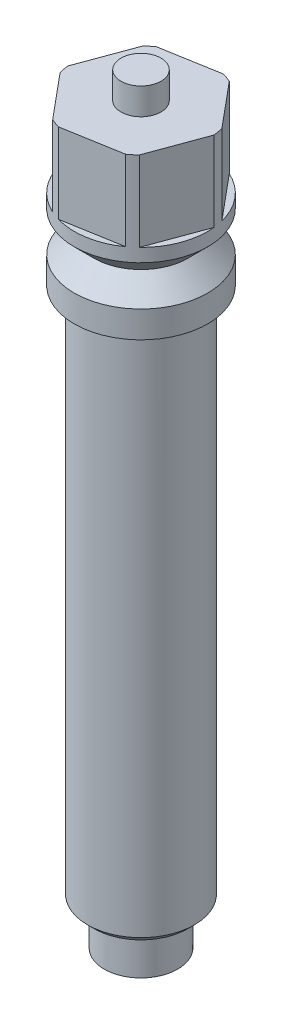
ISO-10303-21;
HEADER;
FILE_DESCRIPTION(('STEP AP214'),'2;1');
FILE_NAME('part.step','',(''),(''),'','','');
FILE_SCHEMA(('AUTOMOTIVE_DESIGN { 1 0 10303 214 1 1 1 1 }'));
ENDSEC;
DATA;
#1=APPLICATION_CONTEXT('core data for automotive mechanical design processes');
#2=APPLICATION_PROTOCOL_DEFINITION('international standard','automotive_design',2000,#1);
#3=PRODUCT_CONTEXT('',#1,'mechanical');
#4=PRODUCT('Part','Part','',(#3));
#5=PRODUCT_RELATED_PRODUCT_CATEGORY('part','',(#4));
#6=PRODUCT_DEFINITION_FORMATION('','',#4);
#7=PRODUCT_DEFINITION_CONTEXT('part definition',#1,'design');
#8=PRODUCT_DEFINITION('design','',#6,#7);
#9=PRODUCT_DEFINITION_SHAPE('','',#8);
#10=(LENGTH_UNIT() NAMED_UNIT(*) SI_UNIT(.MILLI.,.METRE.));
#11=(NAMED_UNIT(*) PLANE_ANGLE_UNIT() SI_UNIT($,.RADIAN.));
#12=(NAMED_UNIT(*) SI_UNIT($,.STERADIAN.) SOLID_ANGLE_UNIT());
#13=UNCERTAINTY_MEASURE_WITH_UNIT(LENGTH_MEASURE(1.E-05),#10,'distance_accuracy_value','');
#14=(GEOMETRIC_REPRESENTATION_CONTEXT(3) GLOBAL_UNCERTAINTY_ASSIGNED_CONTEXT((#13)) GLOBAL_UNIT_ASSIGNED_CONTEXT((#10,
#11,#12)) REPRESENTATION_CONTEXT('',''));
#15=CARTESIAN_POINT('',(0.,0.,0.));
#16=DIRECTION('',(0.,0.,1.));
#17=DIRECTION('',(1.,0.,0.));
#18=AXIS2_PLACEMENT_3D('',#15,#16,#17);
#19=CARTESIAN_POINT('',(0.,-40.,0.));
#20=DIRECTION('',(0.,-1.,0.));
#21=DIRECTION('',(0.,0.,-1.));
#22=AXIS2_PLACEMENT_3D('',#19,#20,#21);
#23=PLANE('',#22);
#24=CARTESIAN_POINT('',(0.,-40.,0.));
#25=DIRECTION('',(0.,-1.,0.));
#26=DIRECTION('',(0.,0.,-1.));
#27=AXIS2_PLACEMENT_3D('',#24,#25,#26);
#28=CIRCLE('',#27,3.5);
#29=CARTESIAN_POINT('',(0.,-40.,-3.5));
#30=VERTEX_POINT('',#29);
#31=EDGE_CURVE('E356',#30,#30,#28,.T.);
#32=ORIENTED_EDGE('',*,*,#31,.T.);
#33=EDGE_LOOP('',(#32));
#34=FACE_BOUND('',#33,.T.);
#35=CARTESIAN_POINT('',(0.,-40.,0.));
#36=DIRECTION('',(0.,-1.,0.));
#37=DIRECTION('',(0.,0.,-1.));
#38=AXIS2_PLACEMENT_3D('',#35,#36,#37);
#39=CIRCLE('',#38,2.75);
#40=CARTESIAN_POINT('',(0.,-40.,-2.75));
#41=VERTEX_POINT('',#40);
#42=EDGE_CURVE('E626',#41,#41,#39,.T.);
#43=ORIENTED_EDGE('',*,*,#42,.F.);
#44=EDGE_LOOP('',(#43));
#45=FACE_BOUND('',#44,.T.);
#46=ADVANCED_FACE('F348',(#34,#45),#23,.T.);
#47=CARTESIAN_POINT('',(0.,0.,0.));
#48=DIRECTION('',(0.,1.,0.));
#49=DIRECTION('',(0.,0.,1.));
#50=AXIS2_PLACEMENT_3D('',#47,#48,#49);
#51=PLANE('',#50);
#52=CARTESIAN_POINT('',(0.,0.,0.));
#53=DIRECTION('',(0.,1.,0.));
#54=DIRECTION('',(0.,0.,1.));
#55=AXIS2_PLACEMENT_3D('',#52,#53,#54);
#56=CIRCLE('',#55,5.);
#57=CARTESIAN_POINT('',(0.,0.,5.));
#58=VERTEX_POINT('',#57);
#59=EDGE_CURVE('E472',#58,#58,#56,.T.);
#60=ORIENTED_EDGE('',*,*,#59,.F.);
#61=EDGE_LOOP('',(#60));
#62=FACE_BOUND('',#61,.T.);
#63=CARTESIAN_POINT('',(0.,0.,0.));
#64=DIRECTION('',(0.,1.,0.));
#65=DIRECTION('',(0.,0.,1.));
#66=AXIS2_PLACEMENT_3D('',#63,#64,#65);
#67=CIRCLE('',#66,4.);
#68=CARTESIAN_POINT('',(0.,0.,4.));
#69=VERTEX_POINT('',#68);
#70=EDGE_CURVE('E500',#69,#69,#67,.F.);
#71=ORIENTED_EDGE('',*,*,#70,.F.);
#72=EDGE_LOOP('',(#71));
#73=FACE_BOUND('',#72,.T.);
#74=ADVANCED_FACE('F521',(#62,#73),#51,.F.);
#75=CARTESIAN_POINT('',(0.,12.,0.));
#76=DIRECTION('',(0.,1.,0.));
#77=DIRECTION('',(0.,0.,1.));
#78=AXIS2_PLACEMENT_3D('',#75,#76,#77);
#79=PLANE('',#78);
#80=CARTESIAN_POINT('',(0.,12.,0.));
#81=DIRECTION('',(0.,1.,0.));
#82=DIRECTION('',(0.,0.,1.));
#83=AXIS2_PLACEMENT_3D('',#80,#81,#82);
#84=CIRCLE('',#83,1.5);
#85=CARTESIAN_POINT('',(0.,12.,1.5));
#86=VERTEX_POINT('',#85);
#87=EDGE_CURVE('E586',#86,#86,#84,.T.);
#88=ORIENTED_EDGE('',*,*,#87,.F.);
#89=EDGE_LOOP('',(#88));
#90=FACE_BOUND('',#89,.T.);
#91=CARTESIAN_POINT('',(0.,12.,0.));
#92=DIRECTION('',(0.,1.,0.));
#93=DIRECTION('',(0.,0.,1.));
#94=AXIS2_PLACEMENT_3D('',#91,#92,#93);
#95=CIRCLE('',#94,5.);
#96=CARTESIAN_POINT('',(2.06183256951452,12.,-4.5550901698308));
#97=VERTEX_POINT('',#96);
#98=CARTESIAN_POINT('',(1.38132784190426,12.,-4.80540668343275));
#99=VERTEX_POINT('',#98);
#100=EDGE_CURVE('E463',#97,#99,#95,.T.);
#101=ORIENTED_EDGE('',*,*,#100,.T.);
#102=DIRECTION('',(-0.985394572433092,0.,0.170286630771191));
#103=VECTOR('',#102,1.);
#104=CARTESIAN_POINT('',(1.79384035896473,12.,-4.87669322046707));
#105=LINE('',#104,#103);
#106=CARTESIAN_POINT('',(-2.91390751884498,12.,-4.06314446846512));
#107=VERTEX_POINT('',#106);
#108=EDGE_CURVE('E448',#99,#107,#105,.T.);
#109=ORIENTED_EDGE('',*,*,#108,.T.);
#110=CARTESIAN_POINT('',(-3.47094034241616,12.,-3.5989683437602));
#111=VERTEX_POINT('',#110);
#112=EDGE_CURVE('E455',#107,#111,#95,.T.);
#113=ORIENTED_EDGE('',*,*,#112,.T.);
#114=DIRECTION('',(-0.345224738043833,0.,0.938520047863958));
#115=VECTOR('',#114,1.);
#116=CARTESIAN_POINT('',(-3.32642003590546,12.,-3.99185793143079));
#117=LINE('',#116,#115);
#118=CARTESIAN_POINT('',(-4.9757400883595,12.,0.491945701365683));
#119=VERTEX_POINT('',#118);
#120=EDGE_CURVE('E436',#111,#119,#117,.T.);
#121=ORIENTED_EDGE('',*,*,#120,.T.);
#122=CARTESIAN_POINT('',(-4.85226818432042,12.,1.20643833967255));
#123=VERTEX_POINT('',#122);
#124=EDGE_CURVE('E464',#119,#123,#95,.T.);
#125=ORIENTED_EDGE('',*,*,#124,.T.);
#126=DIRECTION('',(0.640169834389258,0.,0.768233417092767));
#127=VECTOR('',#126,1.);
#128=CARTESIAN_POINT('',(-5.1202603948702,12.,0.884835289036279));
#129=LINE('',#128,#127);
#130=CARTESIAN_POINT('',(-2.06183256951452,12.,4.5550901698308));
#131=VERTEX_POINT('',#130);
#132=EDGE_CURVE('E447',#123,#131,#129,.T.);
#133=ORIENTED_EDGE('',*,*,#132,.T.);
#134=CARTESIAN_POINT('',(-1.38132784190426,12.,4.80540668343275));
#135=VERTEX_POINT('',#134);
#136=EDGE_CURVE('E467',#131,#135,#95,.T.);
#137=ORIENTED_EDGE('',*,*,#136,.T.);
#138=DIRECTION('',(0.985394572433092,0.,-0.170286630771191));
#139=VECTOR('',#138,1.);
#140=CARTESIAN_POINT('',(-1.79384035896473,12.,4.87669322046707));
#141=LINE('',#140,#139);
#142=CARTESIAN_POINT('',(2.91390751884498,12.,4.06314446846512));
#143=VERTEX_POINT('',#142);
#144=EDGE_CURVE('E608',#135,#143,#141,.T.);
#145=ORIENTED_EDGE('',*,*,#144,.T.);
#146=CARTESIAN_POINT('',(3.47094034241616,12.,3.5989683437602));
#147=VERTEX_POINT('',#146);
#148=EDGE_CURVE('E468',#143,#147,#95,.T.);
#149=ORIENTED_EDGE('',*,*,#148,.T.);
#150=DIRECTION('',(0.345224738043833,0.,-0.938520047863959));
#151=VECTOR('',#150,1.);
#152=CARTESIAN_POINT('',(3.32642003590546,12.,3.99185793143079));
#153=LINE('',#152,#151);
#154=CARTESIAN_POINT('',(4.9757400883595,12.,-0.491945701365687));
#155=VERTEX_POINT('',#154);
#156=EDGE_CURVE('E605',#147,#155,#153,.T.);
#157=ORIENTED_EDGE('',*,*,#156,.T.);
#158=CARTESIAN_POINT('',(4.85226818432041,12.,-1.20643833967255));
#159=VERTEX_POINT('',#158);
#160=EDGE_CURVE('E466',#155,#159,#95,.T.);
#161=ORIENTED_EDGE('',*,*,#160,.T.);
#162=DIRECTION('',(-0.640169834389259,0.,-0.768233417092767));
#163=VECTOR('',#162,1.);
#164=CARTESIAN_POINT('',(5.1202603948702,12.,-0.88483528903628));
#165=LINE('',#164,#163);
#166=EDGE_CURVE('E602',#159,#97,#165,.T.);
#167=ORIENTED_EDGE('',*,*,#166,.T.);
#168=EDGE_LOOP('',(#101,#109,#113,#121,#125,#133,#137,#145,#149,#157,#161,#167));
#169=FACE_BOUND('',#168,.T.);
#170=ADVANCED_FACE('F462',(#90,#169),#79,.T.);
#171=CARTESIAN_POINT('',(0.,12.,0.));
#172=DIRECTION('',(0.,-1.,0.));
#173=DIRECTION('',(0.,0.,-1.));
#174=AXIS2_PLACEMENT_3D('',#171,#172,#173);
#175=CYLINDRICAL_SURFACE('',#174,5.);
#176=CARTESIAN_POINT('',(0.,5.,0.));
#177=DIRECTION('',(0.,1.,0.));
#178=DIRECTION('',(0.,0.,1.));
#179=AXIS2_PLACEMENT_3D('',#176,#177,#178);
#180=CIRCLE('',#179,5.);
#181=CARTESIAN_POINT('',(0.,5.,5.));
#182=VERTEX_POINT('',#181);
#183=EDGE_CURVE('E617',#182,#182,#180,.T.);
#184=ORIENTED_EDGE('',*,*,#183,.T.);
#185=EDGE_LOOP('',(#184));
#186=FACE_BOUND('',#185,.T.);
#187=DIRECTION('',(0.,-1.,0.));
#188=VECTOR('',#187,1.);
#189=CARTESIAN_POINT('',(1.38132784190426,12.,-4.80540668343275));
#190=LINE('',#189,#188);
#191=CARTESIAN_POINT('',(1.38132784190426,6.,-4.80540668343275));
#192=VERTEX_POINT('',#191);
#193=EDGE_CURVE('E498',#99,#192,#190,.T.);
#194=ORIENTED_EDGE('',*,*,#193,.F.);
#195=ORIENTED_EDGE('',*,*,#100,.F.);
#196=DIRECTION('',(0.,-1.,0.));
#197=VECTOR('',#196,1.);
#198=CARTESIAN_POINT('',(2.06183256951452,12.,-4.5550901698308));
#199=LINE('',#198,#197);
#200=CARTESIAN_POINT('',(2.06183256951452,6.,-4.5550901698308));
#201=VERTEX_POINT('',#200);
#202=EDGE_CURVE('E491',#201,#97,#199,.F.);
#203=ORIENTED_EDGE('',*,*,#202,.F.);
#204=CARTESIAN_POINT('',(0.,6.,0.));
#205=DIRECTION('',(0.,1.,0.));
#206=DIRECTION('',(0.,0.,1.));
#207=AXIS2_PLACEMENT_3D('',#204,#205,#206);
#208=CIRCLE('',#207,5.);
#209=CARTESIAN_POINT('',(4.85226818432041,6.,-1.20643833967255));
#210=VERTEX_POINT('',#209);
#211=EDGE_CURVE('E493',#210,#201,#208,.T.);
#212=ORIENTED_EDGE('',*,*,#211,.F.);
#213=DIRECTION('',(0.,-1.,0.));
#214=VECTOR('',#213,1.);
#215=CARTESIAN_POINT('',(4.85226818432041,12.,-1.20643833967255));
#216=LINE('',#215,#214);
#217=EDGE_CURVE('E494',#159,#210,#216,.T.);
#218=ORIENTED_EDGE('',*,*,#217,.F.);
#219=ORIENTED_EDGE('',*,*,#160,.F.);
#220=DIRECTION('',(0.,-1.,0.));
#221=VECTOR('',#220,1.);
#222=CARTESIAN_POINT('',(4.9757400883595,12.,-0.491945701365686));
#223=LINE('',#222,#221);
#224=CARTESIAN_POINT('',(4.9757400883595,6.,-0.491945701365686));
#225=VERTEX_POINT('',#224);
#226=EDGE_CURVE('E486',#225,#155,#223,.F.);
#227=ORIENTED_EDGE('',*,*,#226,.F.);
#228=CARTESIAN_POINT('',(3.47094034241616,6.,3.5989683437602));
#229=VERTEX_POINT('',#228);
#230=EDGE_CURVE('E488',#229,#225,#208,.T.);
#231=ORIENTED_EDGE('',*,*,#230,.F.);
#232=DIRECTION('',(0.,-1.,0.));
#233=VECTOR('',#232,1.);
#234=CARTESIAN_POINT('',(3.47094034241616,12.,3.5989683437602));
#235=LINE('',#234,#233);
#236=EDGE_CURVE('E489',#147,#229,#235,.T.);
#237=ORIENTED_EDGE('',*,*,#236,.F.);
#238=ORIENTED_EDGE('',*,*,#148,.F.);
#239=DIRECTION('',(0.,-1.,0.));
#240=VECTOR('',#239,1.);
#241=CARTESIAN_POINT('',(2.91390751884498,12.,4.06314446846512));
#242=LINE('',#241,#240);
#243=CARTESIAN_POINT('',(2.91390751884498,6.,4.06314446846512));
#244=VERTEX_POINT('',#243);
#245=EDGE_CURVE('E481',#244,#143,#242,.F.);
#246=ORIENTED_EDGE('',*,*,#245,.F.);
#247=CARTESIAN_POINT('',(-1.38132784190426,6.,4.80540668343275));
#248=VERTEX_POINT('',#247);
#249=EDGE_CURVE('E483',#248,#244,#208,.T.);
#250=ORIENTED_EDGE('',*,*,#249,.F.);
#251=DIRECTION('',(0.,-1.,0.));
#252=VECTOR('',#251,1.);
#253=CARTESIAN_POINT('',(-1.38132784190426,12.,4.80540668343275));
#254=LINE('',#253,#252);
#255=EDGE_CURVE('E484',#135,#248,#254,.T.);
#256=ORIENTED_EDGE('',*,*,#255,.F.);
#257=ORIENTED_EDGE('',*,*,#136,.F.);
#258=DIRECTION('',(0.,-1.,0.));
#259=VECTOR('',#258,1.);
#260=CARTESIAN_POINT('',(-2.06183256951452,12.,4.5550901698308));
#261=LINE('',#260,#259);
#262=CARTESIAN_POINT('',(-2.06183256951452,6.,4.5550901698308));
#263=VERTEX_POINT('',#262);
#264=EDGE_CURVE('E458',#263,#131,#261,.F.);
#265=ORIENTED_EDGE('',*,*,#264,.F.);
#266=CARTESIAN_POINT('',(-4.85226818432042,6.,1.20643833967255));
#267=VERTEX_POINT('',#266);
#268=EDGE_CURVE('E476',#267,#263,#208,.T.);
#269=ORIENTED_EDGE('',*,*,#268,.F.);
#270=DIRECTION('',(0.,-1.,0.));
#271=VECTOR('',#270,1.);
#272=CARTESIAN_POINT('',(-4.85226818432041,12.,1.20643833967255));
#273=LINE('',#272,#271);
#274=EDGE_CURVE('E479',#123,#267,#273,.T.);
#275=ORIENTED_EDGE('',*,*,#274,.F.);
#276=ORIENTED_EDGE('',*,*,#124,.F.);
#277=DIRECTION('',(0.,-1.,0.));
#278=VECTOR('',#277,1.);
#279=CARTESIAN_POINT('',(-4.9757400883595,12.,0.491945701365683));
#280=LINE('',#279,#278);
#281=CARTESIAN_POINT('',(-4.9757400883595,6.,0.491945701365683));
#282=VERTEX_POINT('',#281);
#283=EDGE_CURVE('E442',#282,#119,#280,.F.);
#284=ORIENTED_EDGE('',*,*,#283,.F.);
#285=CARTESIAN_POINT('',(-3.47094034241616,6.,-3.5989683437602));
#286=VERTEX_POINT('',#285);
#287=EDGE_CURVE('E457',#286,#282,#208,.T.);
#288=ORIENTED_EDGE('',*,*,#287,.F.);
#289=DIRECTION('',(0.,-1.,0.));
#290=VECTOR('',#289,1.);
#291=CARTESIAN_POINT('',(-3.47094034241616,12.,-3.5989683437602));
#292=LINE('',#291,#290);
#293=EDGE_CURVE('E439',#111,#286,#292,.T.);
#294=ORIENTED_EDGE('',*,*,#293,.F.);
#295=ORIENTED_EDGE('',*,*,#112,.F.);
#296=DIRECTION('',(0.,-1.,0.));
#297=VECTOR('',#296,1.);
#298=CARTESIAN_POINT('',(-2.91390751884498,12.,-4.06314446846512));
#299=LINE('',#298,#297);
#300=CARTESIAN_POINT('',(-2.91390751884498,6.,-4.06314446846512));
#301=VERTEX_POINT('',#300);
#302=EDGE_CURVE('E496',#301,#107,#299,.F.);
#303=ORIENTED_EDGE('',*,*,#302,.F.);
#304=EDGE_CURVE('E475',#192,#301,#208,.T.);
#305=ORIENTED_EDGE('',*,*,#304,.F.);
#306=EDGE_LOOP('',(#194,#195,#203,#212,#218,#219,#227,#231,#237,#238,#246,#250,#256,#257,#265,
#269,#275,#276,#284,#288,#294,#295,#303,#305));
#307=FACE_BOUND('',#306,.T.);
#308=ADVANCED_FACE('F350',(#186,#307),#175,.T.);
#309=CARTESIAN_POINT('',(0.,14.,0.));
#310=DIRECTION('',(0.,-1.,0.));
#311=DIRECTION('',(0.,0.,-1.));
#312=AXIS2_PLACEMENT_3D('',#309,#310,#311);
#313=CYLINDRICAL_SURFACE('',#312,1.5);
#314=CARTESIAN_POINT('',(0.,14.,0.));
#315=DIRECTION('',(0.,1.,0.));
#316=DIRECTION('',(0.,0.,1.));
#317=AXIS2_PLACEMENT_3D('',#314,#315,#316);
#318=CIRCLE('',#317,1.5);
#319=CARTESIAN_POINT('',(0.,14.,1.5));
#320=VERTEX_POINT('',#319);
#321=EDGE_CURVE('E588',#320,#320,#318,.T.);
#322=ORIENTED_EDGE('',*,*,#321,.F.);
#323=EDGE_LOOP('',(#322));
#324=FACE_BOUND('',#323,.T.);
#325=ORIENTED_EDGE('',*,*,#87,.T.);
#326=EDGE_LOOP('',(#325));
#327=FACE_BOUND('',#326,.T.);
#328=ADVANCED_FACE('F574',(#324,#327),#313,.T.);
#329=CARTESIAN_POINT('',(0.,14.,0.));
#330=DIRECTION('',(0.,1.,0.));
#331=DIRECTION('',(0.,0.,1.));
#332=AXIS2_PLACEMENT_3D('',#329,#330,#331);
#333=PLANE('',#332);
#334=ORIENTED_EDGE('',*,*,#321,.T.);
#335=EDGE_LOOP('',(#334));
#336=FACE_BOUND('',#335,.T.);
#337=ADVANCED_FACE('F565',(#336),#333,.T.);
#338=CARTESIAN_POINT('',(-3.32642003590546,6.,-3.99185793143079));
#339=DIRECTION('',(-0.938520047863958,0.,-0.345224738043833));
#340=DIRECTION('',(-0.345224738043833,0.,0.938520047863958));
#341=AXIS2_PLACEMENT_3D('',#338,#339,#340);
#342=PLANE('',#341);
#343=ORIENTED_EDGE('',*,*,#293,.T.);
#344=DIRECTION('',(-0.345224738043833,0.,0.938520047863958));
#345=VECTOR('',#344,1.);
#346=CARTESIAN_POINT('',(-3.32642003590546,6.,-3.99185793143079));
#347=LINE('',#346,#345);
#348=EDGE_CURVE('E599',#286,#282,#347,.T.);
#349=ORIENTED_EDGE('',*,*,#348,.T.);
#350=ORIENTED_EDGE('',*,*,#283,.T.);
#351=ORIENTED_EDGE('',*,*,#120,.F.);
#352=EDGE_LOOP('',(#343,#349,#350,#351));
#353=FACE_BOUND('',#352,.T.);
#354=ADVANCED_FACE('F438',(#353),#342,.T.);
#355=CARTESIAN_POINT('',(0.,6.,0.));
#356=DIRECTION('',(0.,1.,0.));
#357=DIRECTION('',(0.,0.,1.));
#358=AXIS2_PLACEMENT_3D('',#355,#356,#357);
#359=PLANE('',#358);
#360=ORIENTED_EDGE('',*,*,#287,.T.);
#361=ORIENTED_EDGE('',*,*,#348,.F.);
#362=EDGE_LOOP('',(#360,#361));
#363=FACE_BOUND('',#362,.T.);
#364=ADVANCED_FACE('F561',(#363),#359,.T.);
#365=CARTESIAN_POINT('',(-5.1202603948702,6.,0.884835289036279));
#366=DIRECTION('',(-0.768233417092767,0.,0.640169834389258));
#367=DIRECTION('',(0.640169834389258,0.,0.768233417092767));
#368=AXIS2_PLACEMENT_3D('',#365,#366,#367);
#369=PLANE('',#368);
#370=ORIENTED_EDGE('',*,*,#274,.T.);
#371=DIRECTION('',(0.640169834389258,0.,0.768233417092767));
#372=VECTOR('',#371,1.);
#373=CARTESIAN_POINT('',(-5.1202603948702,6.,0.884835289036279));
#374=LINE('',#373,#372);
#375=EDGE_CURVE('E597',#267,#263,#374,.T.);
#376=ORIENTED_EDGE('',*,*,#375,.T.);
#377=ORIENTED_EDGE('',*,*,#264,.T.);
#378=ORIENTED_EDGE('',*,*,#132,.F.);
#379=EDGE_LOOP('',(#370,#376,#377,#378));
#380=FACE_BOUND('',#379,.T.);
#381=ADVANCED_FACE('F558',(#380),#369,.T.);
#382=ORIENTED_EDGE('',*,*,#268,.T.);
#383=ORIENTED_EDGE('',*,*,#375,.F.);
#384=EDGE_LOOP('',(#382,#383));
#385=FACE_BOUND('',#384,.T.);
#386=ADVANCED_FACE('F556',(#385),#359,.T.);
#387=CARTESIAN_POINT('',(-1.79384035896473,6.,4.87669322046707));
#388=DIRECTION('',(0.170286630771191,0.,0.985394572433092));
#389=DIRECTION('',(0.985394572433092,0.,-0.170286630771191));
#390=AXIS2_PLACEMENT_3D('',#387,#388,#389);
#391=PLANE('',#390);
#392=ORIENTED_EDGE('',*,*,#255,.T.);
#393=DIRECTION('',(0.985394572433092,0.,-0.170286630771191));
#394=VECTOR('',#393,1.);
#395=CARTESIAN_POINT('',(-1.79384035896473,6.,4.87669322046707));
#396=LINE('',#395,#394);
#397=EDGE_CURVE('E595',#248,#244,#396,.T.);
#398=ORIENTED_EDGE('',*,*,#397,.T.);
#399=ORIENTED_EDGE('',*,*,#245,.T.);
#400=ORIENTED_EDGE('',*,*,#144,.F.);
#401=EDGE_LOOP('',(#392,#398,#399,#400));
#402=FACE_BOUND('',#401,.T.);
#403=ADVANCED_FACE('F553',(#402),#391,.T.);
#404=ORIENTED_EDGE('',*,*,#249,.T.);
#405=ORIENTED_EDGE('',*,*,#397,.F.);
#406=EDGE_LOOP('',(#404,#405));
#407=FACE_BOUND('',#406,.T.);
#408=ADVANCED_FACE('F551',(#407),#359,.T.);
#409=CARTESIAN_POINT('',(3.32642003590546,6.,3.99185793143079));
#410=DIRECTION('',(0.938520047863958,0.,0.345224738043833));
#411=DIRECTION('',(0.345224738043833,0.,-0.938520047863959));
#412=AXIS2_PLACEMENT_3D('',#409,#410,#411);
#413=PLANE('',#412);
#414=ORIENTED_EDGE('',*,*,#236,.T.);
#415=DIRECTION('',(0.345224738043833,0.,-0.938520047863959));
#416=VECTOR('',#415,1.);
#417=CARTESIAN_POINT('',(3.32642003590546,6.,3.99185793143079));
#418=LINE('',#417,#416);
#419=EDGE_CURVE('E591',#229,#225,#418,.T.);
#420=ORIENTED_EDGE('',*,*,#419,.T.);
#421=ORIENTED_EDGE('',*,*,#226,.T.);
#422=ORIENTED_EDGE('',*,*,#156,.F.);
#423=EDGE_LOOP('',(#414,#420,#421,#422));
#424=FACE_BOUND('',#423,.T.);
#425=ADVANCED_FACE('F548',(#424),#413,.T.);
#426=ORIENTED_EDGE('',*,*,#230,.T.);
#427=ORIENTED_EDGE('',*,*,#419,.F.);
#428=EDGE_LOOP('',(#426,#427));
#429=FACE_BOUND('',#428,.T.);
#430=ADVANCED_FACE('F547',(#429),#359,.T.);
#431=CARTESIAN_POINT('',(5.1202603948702,6.,-0.88483528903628));
#432=DIRECTION('',(0.768233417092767,0.,-0.640169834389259));
#433=DIRECTION('',(-0.640169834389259,0.,-0.768233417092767));
#434=AXIS2_PLACEMENT_3D('',#431,#432,#433);
#435=PLANE('',#434);
#436=ORIENTED_EDGE('',*,*,#217,.T.);
#437=DIRECTION('',(-0.640169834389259,0.,-0.768233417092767));
#438=VECTOR('',#437,1.);
#439=CARTESIAN_POINT('',(5.1202603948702,6.,-0.88483528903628));
#440=LINE('',#439,#438);
#441=EDGE_CURVE('E371',#210,#201,#440,.T.);
#442=ORIENTED_EDGE('',*,*,#441,.T.);
#443=ORIENTED_EDGE('',*,*,#202,.T.);
#444=ORIENTED_EDGE('',*,*,#166,.F.);
#445=EDGE_LOOP('',(#436,#442,#443,#444));
#446=FACE_BOUND('',#445,.T.);
#447=ADVANCED_FACE('F543',(#446),#435,.T.);
#448=ORIENTED_EDGE('',*,*,#211,.T.);
#449=ORIENTED_EDGE('',*,*,#441,.F.);
#450=EDGE_LOOP('',(#448,#449));
#451=FACE_BOUND('',#450,.T.);
#452=ADVANCED_FACE('F546',(#451),#359,.T.);
#453=ORIENTED_EDGE('',*,*,#304,.T.);
#454=DIRECTION('',(-0.985394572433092,0.,0.170286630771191));
#455=VECTOR('',#454,1.);
#456=CARTESIAN_POINT('',(1.79384035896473,6.,-4.87669322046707));
#457=LINE('',#456,#455);
#458=EDGE_CURVE('E363',#192,#301,#457,.T.);
#459=ORIENTED_EDGE('',*,*,#458,.F.);
#460=EDGE_LOOP('',(#453,#459));
#461=FACE_BOUND('',#460,.T.);
#462=ADVANCED_FACE('F568',(#461),#359,.T.);
#463=CARTESIAN_POINT('',(1.79384035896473,6.,-4.87669322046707));
#464=DIRECTION('',(-0.170286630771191,0.,-0.985394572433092));
#465=DIRECTION('',(-0.985394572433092,0.,0.170286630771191));
#466=AXIS2_PLACEMENT_3D('',#463,#464,#465);
#467=PLANE('',#466);
#468=ORIENTED_EDGE('',*,*,#193,.T.);
#469=ORIENTED_EDGE('',*,*,#458,.T.);
#470=ORIENTED_EDGE('',*,*,#302,.T.);
#471=ORIENTED_EDGE('',*,*,#108,.F.);
#472=EDGE_LOOP('',(#468,#469,#470,#471));
#473=FACE_BOUND('',#472,.T.);
#474=ADVANCED_FACE('F541',(#473),#467,.T.);
#475=CARTESIAN_POINT('',(0.,2.,0.));
#476=DIRECTION('',(0.,-1.,0.));
#477=DIRECTION('',(0.,0.,-1.));
#478=AXIS2_PLACEMENT_3D('',#475,#476,#477);
#479=CONICAL_SURFACE('',#478,5.,0.785398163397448);
#480=CARTESIAN_POINT('',(0.,3.5,0.));
#481=DIRECTION('',(0.,1.,0.));
#482=DIRECTION('',(0.,0.,1.));
#483=AXIS2_PLACEMENT_3D('',#480,#481,#482);
#484=CIRCLE('',#483,3.5);
#485=CARTESIAN_POINT('',(0.,3.5,3.5));
#486=VERTEX_POINT('',#485);
#487=EDGE_CURVE('E620',#486,#486,#484,.T.);
#488=ORIENTED_EDGE('',*,*,#487,.F.);
#489=EDGE_LOOP('',(#488));
#490=FACE_BOUND('',#489,.T.);
#491=CARTESIAN_POINT('',(0.,2.,0.));
#492=DIRECTION('',(0.,1.,0.));
#493=DIRECTION('',(0.,0.,1.));
#494=AXIS2_PLACEMENT_3D('',#491,#492,#493);
#495=CIRCLE('',#494,5.);
#496=CARTESIAN_POINT('',(0.,2.,5.));
#497=VERTEX_POINT('',#496);
#498=EDGE_CURVE('E614',#497,#497,#495,.T.);
#499=ORIENTED_EDGE('',*,*,#498,.T.);
#500=EDGE_LOOP('',(#499));
#501=FACE_BOUND('',#500,.T.);
#502=ADVANCED_FACE('F537',(#490,#501),#479,.T.);
#503=CARTESIAN_POINT('',(0.,3.5,0.));
#504=DIRECTION('',(0.,1.,0.));
#505=DIRECTION('',(0.,0.,1.));
#506=AXIS2_PLACEMENT_3D('',#503,#504,#505);
#507=CONICAL_SURFACE('',#506,3.5,0.785398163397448);
#508=ORIENTED_EDGE('',*,*,#183,.F.);
#509=EDGE_LOOP('',(#508));
#510=FACE_BOUND('',#509,.T.);
#511=ORIENTED_EDGE('',*,*,#487,.T.);
#512=EDGE_LOOP('',(#511));
#513=FACE_BOUND('',#512,.T.);
#514=ADVANCED_FACE('F534',(#510,#513),#507,.T.);
#515=ORIENTED_EDGE('',*,*,#498,.F.);
#516=EDGE_LOOP('',(#515));
#517=FACE_BOUND('',#516,.T.);
#518=ORIENTED_EDGE('',*,*,#59,.T.);
#519=EDGE_LOOP('',(#518));
#520=FACE_BOUND('',#519,.T.);
#521=ADVANCED_FACE('F532',(#517,#520),#175,.T.);
#522=CARTESIAN_POINT('',(0.,-40.,0.));
#523=DIRECTION('',(0.,1.,0.));
#524=DIRECTION('',(0.,0.,1.));
#525=AXIS2_PLACEMENT_3D('',#522,#523,#524);
#526=CYLINDRICAL_SURFACE('',#525,4.);
#527=CARTESIAN_POINT('',(0.,-39.5,0.));
#528=DIRECTION('',(0.,-1.,0.));
#529=DIRECTION('',(0.,0.,-1.));
#530=AXIS2_PLACEMENT_3D('',#527,#528,#529);
#531=CIRCLE('',#530,4.);
#532=CARTESIAN_POINT('',(0.,-39.5,-4.));
#533=VERTEX_POINT('',#532);
#534=EDGE_CURVE('E11',#533,#533,#531,.F.);
#535=ORIENTED_EDGE('',*,*,#534,.T.);
#536=EDGE_LOOP('',(#535));
#537=FACE_BOUND('',#536,.T.);
#538=ORIENTED_EDGE('',*,*,#70,.T.);
#539=EDGE_LOOP('',(#538));
#540=FACE_BOUND('',#539,.T.);
#541=ADVANCED_FACE('F530',(#537,#540),#526,.T.);
#542=CARTESIAN_POINT('',(0.,-43.,0.));
#543=DIRECTION('',(0.,1.,0.));
#544=DIRECTION('',(0.,0.,1.));
#545=AXIS2_PLACEMENT_3D('',#542,#543,#544);
#546=CYLINDRICAL_SURFACE('',#545,2.75);
#547=CARTESIAN_POINT('',(0.,-43.,0.));
#548=DIRECTION('',(0.,-1.,0.));
#549=DIRECTION('',(0.,0.,-1.));
#550=AXIS2_PLACEMENT_3D('',#547,#548,#549);
#551=CIRCLE('',#550,2.75);
#552=CARTESIAN_POINT('',(0.,-43.,-2.75));
#553=VERTEX_POINT('',#552);
#554=EDGE_CURVE('E623',#553,#553,#551,.T.);
#555=ORIENTED_EDGE('',*,*,#554,.F.);
#556=EDGE_LOOP('',(#555));
#557=FACE_BOUND('',#556,.T.);
#558=ORIENTED_EDGE('',*,*,#42,.T.);
#559=EDGE_LOOP('',(#558));
#560=FACE_BOUND('',#559,.T.);
#561=ADVANCED_FACE('F516',(#557,#560),#546,.T.);
#562=CARTESIAN_POINT('',(0.,-43.,0.));
#563=DIRECTION('',(0.,-1.,0.));
#564=DIRECTION('',(0.,0.,-1.));
#565=AXIS2_PLACEMENT_3D('',#562,#563,#564);
#566=PLANE('',#565);
#567=ORIENTED_EDGE('',*,*,#554,.T.);
#568=EDGE_LOOP('',(#567));
#569=FACE_BOUND('',#568,.T.);
#570=ADVANCED_FACE('F509',(#569),#566,.T.);
#571=CARTESIAN_POINT('',(0.,-40.,0.));
#572=DIRECTION('',(0.,1.,0.));
#573=DIRECTION('',(0.,0.,1.));
#574=AXIS2_PLACEMENT_3D('',#571,#572,#573);
#575=CONICAL_SURFACE('',#574,3.5,0.785398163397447);
#576=ORIENTED_EDGE('',*,*,#534,.F.);
#577=EDGE_LOOP('',(#576));
#578=FACE_BOUND('',#577,.T.);
#579=ORIENTED_EDGE('',*,*,#31,.F.);
#580=EDGE_LOOP('',(#579));
#581=FACE_BOUND('',#580,.T.);
#582=ADVANCED_FACE('F507',(#578,#581),#575,.T.);
#583=CLOSED_SHELL('',(#46,#74,#170,#308,#328,#337,#354,#364,#381,#386,#403,#408,#425,#430,#447,
#452,#462,#474,#502,#514,#521,#541,#561,#570,#582));
#584=MANIFOLD_SOLID_BREP('B2',#583);
#585=ADVANCED_BREP_SHAPE_REPRESENTATION('',(#18,#584),#14);
#586=SHAPE_DEFINITION_REPRESENTATION(#9,#585);
ENDSEC;
END-ISO-10303-21;
